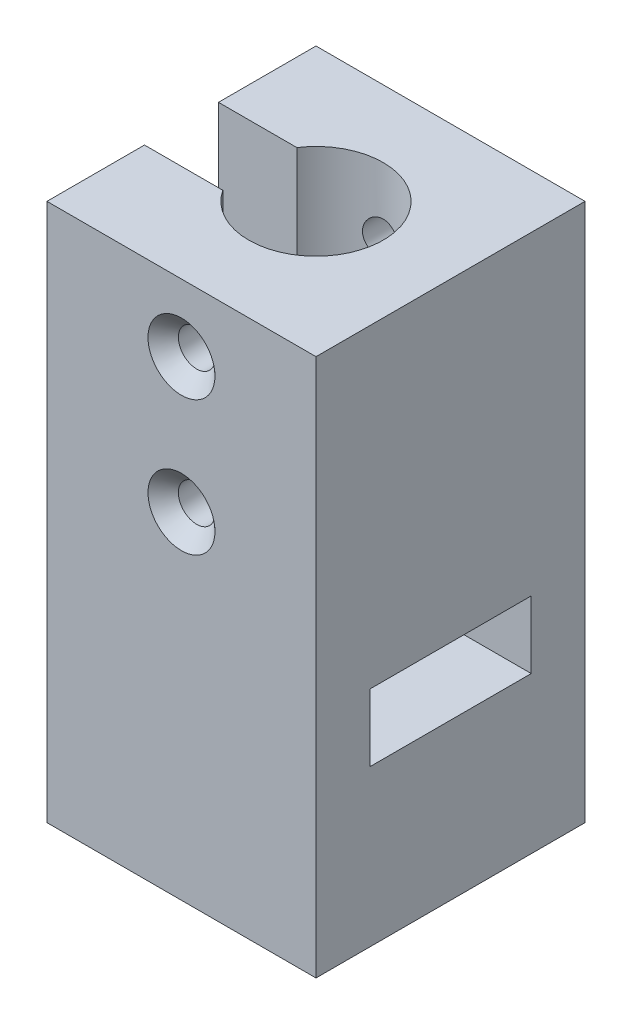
ISO-10303-21;
HEADER;
FILE_DESCRIPTION(('STEP AP214'),'2;1');
FILE_NAME('part.step','',(''),(''),'','','');
FILE_SCHEMA(('AUTOMOTIVE_DESIGN { 1 0 10303 214 1 1 1 1 }'));
ENDSEC;
DATA;
#1=APPLICATION_CONTEXT('core data for automotive mechanical design processes');
#2=APPLICATION_PROTOCOL_DEFINITION('international standard','automotive_design',2000,#1);
#3=PRODUCT_CONTEXT('',#1,'mechanical');
#4=PRODUCT('Part','Part','',(#3));
#5=PRODUCT_RELATED_PRODUCT_CATEGORY('part','',(#4));
#6=PRODUCT_DEFINITION_FORMATION('','',#4);
#7=PRODUCT_DEFINITION_CONTEXT('part definition',#1,'design');
#8=PRODUCT_DEFINITION('design','',#6,#7);
#9=PRODUCT_DEFINITION_SHAPE('','',#8);
#10=(LENGTH_UNIT() NAMED_UNIT(*) SI_UNIT(.MILLI.,.METRE.));
#11=(NAMED_UNIT(*) PLANE_ANGLE_UNIT() SI_UNIT($,.RADIAN.));
#12=(NAMED_UNIT(*) SI_UNIT($,.STERADIAN.) SOLID_ANGLE_UNIT());
#13=UNCERTAINTY_MEASURE_WITH_UNIT(LENGTH_MEASURE(1.E-05),#10,'distance_accuracy_value','');
#14=(GEOMETRIC_REPRESENTATION_CONTEXT(3) GLOBAL_UNCERTAINTY_ASSIGNED_CONTEXT((#13)) GLOBAL_UNIT_ASSIGNED_CONTEXT((#10,
#11,#12)) REPRESENTATION_CONTEXT('',''));
#15=CARTESIAN_POINT('',(0.,0.,0.));
#16=DIRECTION('',(0.,0.,1.));
#17=DIRECTION('',(1.,0.,0.));
#18=AXIS2_PLACEMENT_3D('',#15,#16,#17);
#19=CARTESIAN_POINT('',(-26.6053608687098,6.35,-9.48462085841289));
#20=DIRECTION('',(0.,1.,0.));
#21=DIRECTION('',(0.,0.,1.));
#22=AXIS2_PLACEMENT_3D('',#19,#20,#21);
#23=CYLINDRICAL_SURFACE('',#22,4.44499999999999);
#24=CARTESIAN_POINT('',(-26.6053608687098,14.732,-9.48462085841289));
#25=DIRECTION('',(0.,-1.,0.));
#26=DIRECTION('',(0.,0.,-1.));
#27=AXIS2_PLACEMENT_3D('',#24,#25,#26);
#28=CIRCLE('',#27,4.44499999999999);
#29=CARTESIAN_POINT('',(-26.6053608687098,14.732,-13.9296208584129));
#30=VERTEX_POINT('',#29);
#31=EDGE_CURVE('E268',#30,#30,#28,.F.);
#32=ORIENTED_EDGE('',*,*,#31,.T.);
#33=EDGE_LOOP('',(#32));
#34=FACE_BOUND('',#33,.T.);
#35=DIRECTION('',(0.,1.,0.));
#36=VECTOR('',#35,1.);
#37=CARTESIAN_POINT('',(-26.6053608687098,7.9502,-5.03962085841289));
#38=LINE('',#37,#36);
#39=CARTESIAN_POINT('',(-26.6053608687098,6.35,-5.03962085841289));
#40=VERTEX_POINT('',#39);
#41=CARTESIAN_POINT('',(-26.6053608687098,7.9502,-5.03962085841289));
#42=VERTEX_POINT('',#41);
#43=EDGE_CURVE('E199',#40,#42,#38,.T.);
#44=ORIENTED_EDGE('',*,*,#43,.T.);
#45=CARTESIAN_POINT('',(-26.6053608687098,7.9502,-9.48462085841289));
#46=DIRECTION('',(0.,1.,0.));
#47=DIRECTION('',(0.,0.,1.));
#48=AXIS2_PLACEMENT_3D('',#45,#46,#47);
#49=CIRCLE('',#48,4.44499999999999);
#50=CARTESIAN_POINT('',(-26.6053608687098,7.9502,-13.9296208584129));
#51=VERTEX_POINT('',#50);
#52=EDGE_CURVE('E13',#42,#51,#49,.F.);
#53=ORIENTED_EDGE('',*,*,#52,.T.);
#54=DIRECTION('',(0.,-1.,0.));
#55=VECTOR('',#54,1.);
#56=CARTESIAN_POINT('',(-26.6053608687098,7.9502,-13.9296208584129));
#57=LINE('',#56,#55);
#58=CARTESIAN_POINT('',(-26.6053608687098,6.35,-13.9296208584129));
#59=VERTEX_POINT('',#58);
#60=EDGE_CURVE('E203',#51,#59,#57,.T.);
#61=ORIENTED_EDGE('',*,*,#60,.T.);
#62=CARTESIAN_POINT('',(-26.6053608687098,6.35,-9.48462085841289));
#63=DIRECTION('',(0.,1.,0.));
#64=DIRECTION('',(0.,0.,1.));
#65=AXIS2_PLACEMENT_3D('',#62,#63,#64);
#66=CIRCLE('',#65,4.44499999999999);
#67=EDGE_CURVE('E188',#40,#59,#66,.T.);
#68=ORIENTED_EDGE('',*,*,#67,.F.);
#69=EDGE_LOOP('',(#44,#53,#61,#68));
#70=FACE_BOUND('',#69,.T.);
#71=ADVANCED_FACE('F59',(#34,#70),#23,.F.);
#72=DIRECTION('',(0.,1.,0.));
#73=VECTOR('',#72,1.);
#74=CARTESIAN_POINT('',(-29.3549915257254,6.35,-12.9771208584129));
#75=LINE('',#74,#73);
#76=CARTESIAN_POINT('',(-29.3549915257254,25.4,-12.9771208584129));
#77=VERTEX_POINT('',#76);
#78=CARTESIAN_POINT('',(-29.3549915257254,21.082,-12.9771208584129));
#79=VERTEX_POINT('',#78);
#80=EDGE_CURVE('E262',#77,#79,#75,.F.);
#81=ORIENTED_EDGE('',*,*,#80,.T.);
#82=CARTESIAN_POINT('',(-26.6053608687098,21.082,-9.48462085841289));
#83=DIRECTION('',(0.,1.,0.));
#84=DIRECTION('',(0.,0.,1.));
#85=AXIS2_PLACEMENT_3D('',#82,#83,#84);
#86=CIRCLE('',#85,4.44499999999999);
#87=CARTESIAN_POINT('',(-29.3549915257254,21.082,-5.99212085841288));
#88=VERTEX_POINT('',#87);
#89=EDGE_CURVE('E281',#79,#88,#86,.F.);
#90=ORIENTED_EDGE('',*,*,#89,.T.);
#91=DIRECTION('',(0.,1.,0.));
#92=VECTOR('',#91,1.);
#93=CARTESIAN_POINT('',(-29.3549915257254,6.35,-5.99212085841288));
#94=LINE('',#93,#92);
#95=CARTESIAN_POINT('',(-29.3549915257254,25.4,-5.99212085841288));
#96=VERTEX_POINT('',#95);
#97=EDGE_CURVE('E258',#88,#96,#94,.T.);
#98=ORIENTED_EDGE('',*,*,#97,.T.);
#99=CARTESIAN_POINT('',(-26.6053608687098,25.4,-9.48462085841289));
#100=DIRECTION('',(0.,1.,0.));
#101=DIRECTION('',(0.,0.,1.));
#102=AXIS2_PLACEMENT_3D('',#99,#100,#101);
#103=CIRCLE('',#102,4.44499999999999);
#104=EDGE_CURVE('E207',#77,#96,#103,.F.);
#105=ORIENTED_EDGE('',*,*,#104,.F.);
#106=EDGE_LOOP('',(#81,#90,#98,#105));
#107=FACE_BOUND('',#106,.T.);
#108=ADVANCED_FACE('F470',(#107),#23,.F.);
#109=CARTESIAN_POINT('',(-39.3053608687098,50.8,-22.1846208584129));
#110=DIRECTION('',(1.,0.,0.));
#111=DIRECTION('',(0.,0.,-1.));
#112=AXIS2_PLACEMENT_3D('',#109,#110,#111);
#113=PLANE('',#112);
#114=DIRECTION('',(0.,0.,1.));
#115=VECTOR('',#114,1.);
#116=CARTESIAN_POINT('',(-39.3053608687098,6.35,-13.9296208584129));
#117=LINE('',#116,#115);
#118=CARTESIAN_POINT('',(-39.3053608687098,6.35,-13.9296208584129));
#119=VERTEX_POINT('',#118);
#120=CARTESIAN_POINT('',(-39.3053608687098,6.35,-5.03962085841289));
#121=VERTEX_POINT('',#120);
#122=EDGE_CURVE('E190',#119,#121,#117,.T.);
#123=ORIENTED_EDGE('',*,*,#122,.F.);
#124=DIRECTION('',(0.,-1.,0.));
#125=VECTOR('',#124,1.);
#126=CARTESIAN_POINT('',(-39.3053608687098,7.9502,-13.9296208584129));
#127=LINE('',#126,#125);
#128=CARTESIAN_POINT('',(-39.3053608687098,7.9502,-13.9296208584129));
#129=VERTEX_POINT('',#128);
#130=EDGE_CURVE('E75',#129,#119,#127,.T.);
#131=ORIENTED_EDGE('',*,*,#130,.F.);
#132=DIRECTION('',(0.,0.,-1.));
#133=VECTOR('',#132,1.);
#134=CARTESIAN_POINT('',(-39.3053608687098,7.9502,-13.9296208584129));
#135=LINE('',#134,#133);
#136=CARTESIAN_POINT('',(-39.3053608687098,7.9502,-5.03962085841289));
#137=VERTEX_POINT('',#136);
#138=EDGE_CURVE('E730',#137,#129,#135,.T.);
#139=ORIENTED_EDGE('',*,*,#138,.F.);
#140=DIRECTION('',(0.,1.,0.));
#141=VECTOR('',#140,1.);
#142=CARTESIAN_POINT('',(-39.3053608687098,7.9502,-5.03962085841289));
#143=LINE('',#142,#141);
#144=EDGE_CURVE('E725',#121,#137,#143,.T.);
#145=ORIENTED_EDGE('',*,*,#144,.F.);
#146=EDGE_LOOP('',(#123,#131,#139,#145));
#147=FACE_BOUND('',#146,.T.);
#148=DIRECTION('',(0.,-1.,0.));
#149=VECTOR('',#148,1.);
#150=CARTESIAN_POINT('',(-39.3053608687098,21.082,-17.1046208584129));
#151=LINE('',#150,#149);
#152=CARTESIAN_POINT('',(-39.3053608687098,21.082,-17.1046208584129));
#153=VERTEX_POINT('',#152);
#154=CARTESIAN_POINT('',(-39.3053608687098,14.732,-17.1046208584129));
#155=VERTEX_POINT('',#154);
#156=EDGE_CURVE('E337',#153,#155,#151,.T.);
#157=ORIENTED_EDGE('',*,*,#156,.F.);
#158=DIRECTION('',(0.,0.,-1.));
#159=VECTOR('',#158,1.);
#160=CARTESIAN_POINT('',(-39.3053608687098,21.082,-17.1046208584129));
#161=LINE('',#160,#159);
#162=CARTESIAN_POINT('',(-39.3053608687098,21.082,-12.9771208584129));
#163=VERTEX_POINT('',#162);
#164=EDGE_CURVE('E334',#163,#153,#161,.T.);
#165=ORIENTED_EDGE('',*,*,#164,.F.);
#166=DIRECTION('',(0.,-1.,0.));
#167=VECTOR('',#166,1.);
#168=CARTESIAN_POINT('',(-39.3053608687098,50.8,-12.9771208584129));
#169=LINE('',#168,#167);
#170=CARTESIAN_POINT('',(-39.3053608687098,50.8,-12.9771208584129));
#171=VERTEX_POINT('',#170);
#172=EDGE_CURVE('E271',#171,#163,#169,.T.);
#173=ORIENTED_EDGE('',*,*,#172,.F.);
#174=DIRECTION('',(0.,0.,1.));
#175=VECTOR('',#174,1.);
#176=CARTESIAN_POINT('',(-39.3053608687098,50.8,-22.1846208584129));
#177=LINE('',#176,#175);
#178=CARTESIAN_POINT('',(-39.3053608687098,50.8,-22.1846208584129));
#179=VERTEX_POINT('',#178);
#180=EDGE_CURVE('E221',#179,#171,#177,.T.);
#181=ORIENTED_EDGE('',*,*,#180,.F.);
#182=DIRECTION('',(0.,-1.,0.));
#183=VECTOR('',#182,1.);
#184=CARTESIAN_POINT('',(-39.3053608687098,50.8,-22.1846208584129));
#185=LINE('',#184,#183);
#186=CARTESIAN_POINT('',(-39.3053608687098,0.,-22.1846208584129));
#187=VERTEX_POINT('',#186);
#188=EDGE_CURVE('E234',#179,#187,#185,.T.);
#189=ORIENTED_EDGE('',*,*,#188,.T.);
#190=DIRECTION('',(0.,0.,1.));
#191=VECTOR('',#190,1.);
#192=CARTESIAN_POINT('',(-39.3053608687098,0.,-22.1846208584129));
#193=LINE('',#192,#191);
#194=CARTESIAN_POINT('',(-39.3053608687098,0.,3.21537914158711));
#195=VERTEX_POINT('',#194);
#196=EDGE_CURVE('E206',#187,#195,#193,.T.);
#197=ORIENTED_EDGE('',*,*,#196,.T.);
#198=DIRECTION('',(0.,-1.,0.));
#199=VECTOR('',#198,1.);
#200=CARTESIAN_POINT('',(-39.3053608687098,50.8,3.21537914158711));
#201=LINE('',#200,#199);
#202=CARTESIAN_POINT('',(-39.3053608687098,50.8,3.21537914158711));
#203=VERTEX_POINT('',#202);
#204=EDGE_CURVE('E255',#203,#195,#201,.T.);
#205=ORIENTED_EDGE('',*,*,#204,.F.);
#206=CARTESIAN_POINT('',(-39.3053608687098,50.8,-5.99212085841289));
#207=VERTEX_POINT('',#206);
#208=EDGE_CURVE('E226',#207,#203,#177,.T.);
#209=ORIENTED_EDGE('',*,*,#208,.F.);
#210=DIRECTION('',(0.,1.,0.));
#211=VECTOR('',#210,1.);
#212=CARTESIAN_POINT('',(-39.3053608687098,50.8,-5.99212085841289));
#213=LINE('',#212,#211);
#214=CARTESIAN_POINT('',(-39.3053608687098,21.082,-5.99212085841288));
#215=VERTEX_POINT('',#214);
#216=EDGE_CURVE('E278',#215,#207,#213,.T.);
#217=ORIENTED_EDGE('',*,*,#216,.F.);
#218=CARTESIAN_POINT('',(-39.3053608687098,21.082,-1.86462085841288));
#219=VERTEX_POINT('',#218);
#220=EDGE_CURVE('E341',#219,#215,#161,.T.);
#221=ORIENTED_EDGE('',*,*,#220,.F.);
#222=DIRECTION('',(0.,1.,0.));
#223=VECTOR('',#222,1.);
#224=CARTESIAN_POINT('',(-39.3053608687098,21.082,-1.86462085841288));
#225=LINE('',#224,#223);
#226=CARTESIAN_POINT('',(-39.3053608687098,14.732,-1.86462085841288));
#227=VERTEX_POINT('',#226);
#228=EDGE_CURVE('E342',#227,#219,#225,.T.);
#229=ORIENTED_EDGE('',*,*,#228,.F.);
#230=DIRECTION('',(0.,0.,1.));
#231=VECTOR('',#230,1.);
#232=CARTESIAN_POINT('',(-39.3053608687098,14.732,-17.1046208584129));
#233=LINE('',#232,#231);
#234=EDGE_CURVE('E348',#155,#227,#233,.T.);
#235=ORIENTED_EDGE('',*,*,#234,.F.);
#236=EDGE_LOOP('',(#157,#165,#173,#181,#189,#197,#205,#209,#217,#221,#229,#235));
#237=FACE_BOUND('',#236,.T.);
#238=ADVANCED_FACE('F61',(#147,#237),#113,.F.);
#239=CARTESIAN_POINT('',(-39.3053608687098,50.8,3.21537914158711));
#240=DIRECTION('',(0.,0.,-1.));
#241=DIRECTION('',(-1.,0.,0.));
#242=AXIS2_PLACEMENT_3D('',#239,#240,#241);
#243=PLANE('',#242);
#244=CARTESIAN_POINT('',(-26.6053608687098,44.45,3.21537914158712));
#245=DIRECTION('',(0.,0.,1.));
#246=DIRECTION('',(1.,0.,0.));
#247=AXIS2_PLACEMENT_3D('',#244,#245,#246);
#248=CIRCLE('',#247,3.1623);
#249=CARTESIAN_POINT('',(-23.4430608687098,44.45,3.21537914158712));
#250=VERTEX_POINT('',#249);
#251=EDGE_CURVE('E740',#250,#250,#248,.T.);
#252=ORIENTED_EDGE('',*,*,#251,.F.);
#253=EDGE_LOOP('',(#252));
#254=FACE_BOUND('',#253,.T.);
#255=CARTESIAN_POINT('',(-26.6053608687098,31.75,3.21537914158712));
#256=DIRECTION('',(0.,0.,1.));
#257=DIRECTION('',(1.,0.,0.));
#258=AXIS2_PLACEMENT_3D('',#255,#256,#257);
#259=CIRCLE('',#258,3.1623);
#260=CARTESIAN_POINT('',(-23.4430608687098,31.75,3.21537914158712));
#261=VERTEX_POINT('',#260);
#262=EDGE_CURVE('E760',#261,#261,#259,.T.);
#263=ORIENTED_EDGE('',*,*,#262,.F.);
#264=EDGE_LOOP('',(#263));
#265=FACE_BOUND('',#264,.T.);
#266=DIRECTION('',(1.,0.,0.));
#267=VECTOR('',#266,1.);
#268=CARTESIAN_POINT('',(-39.3053608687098,0.,3.21537914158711));
#269=LINE('',#268,#267);
#270=CARTESIAN_POINT('',(-13.9053608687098,0.,3.21537914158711));
#271=VERTEX_POINT('',#270);
#272=EDGE_CURVE('E212',#195,#271,#269,.T.);
#273=ORIENTED_EDGE('',*,*,#272,.T.);
#274=DIRECTION('',(0.,-1.,0.));
#275=VECTOR('',#274,1.);
#276=CARTESIAN_POINT('',(-13.9053608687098,50.8,3.21537914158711));
#277=LINE('',#276,#275);
#278=CARTESIAN_POINT('',(-13.9053608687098,50.8,3.21537914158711));
#279=VERTEX_POINT('',#278);
#280=EDGE_CURVE('E251',#279,#271,#277,.T.);
#281=ORIENTED_EDGE('',*,*,#280,.F.);
#282=DIRECTION('',(1.,0.,0.));
#283=VECTOR('',#282,1.);
#284=CARTESIAN_POINT('',(-39.3053608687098,50.8,3.21537914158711));
#285=LINE('',#284,#283);
#286=EDGE_CURVE('E225',#203,#279,#285,.T.);
#287=ORIENTED_EDGE('',*,*,#286,.F.);
#288=ORIENTED_EDGE('',*,*,#204,.T.);
#289=EDGE_LOOP('',(#273,#281,#287,#288));
#290=FACE_BOUND('',#289,.T.);
#291=ADVANCED_FACE('F460',(#254,#265,#290),#243,.F.);
#292=CARTESIAN_POINT('',(-13.9053608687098,50.8,-22.1846208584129));
#293=DIRECTION('',(-1.,0.,0.));
#294=DIRECTION('',(0.,0.,1.));
#295=AXIS2_PLACEMENT_3D('',#292,#293,#294);
#296=PLANE('',#295);
#297=DIRECTION('',(0.,0.,-1.));
#298=VECTOR('',#297,1.);
#299=CARTESIAN_POINT('',(-13.9053608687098,21.082,-17.1046208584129));
#300=LINE('',#299,#298);
#301=CARTESIAN_POINT('',(-13.9053608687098,21.082,-1.86462085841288));
#302=VERTEX_POINT('',#301);
#303=CARTESIAN_POINT('',(-13.9053608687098,21.082,-17.1046208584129));
#304=VERTEX_POINT('',#303);
#305=EDGE_CURVE('E361',#302,#304,#300,.T.);
#306=ORIENTED_EDGE('',*,*,#305,.T.);
#307=DIRECTION('',(0.,-1.,0.));
#308=VECTOR('',#307,1.);
#309=CARTESIAN_POINT('',(-13.9053608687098,21.082,-17.1046208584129));
#310=LINE('',#309,#308);
#311=CARTESIAN_POINT('',(-13.9053608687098,14.732,-17.1046208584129));
#312=VERTEX_POINT('',#311);
#313=EDGE_CURVE('E346',#304,#312,#310,.T.);
#314=ORIENTED_EDGE('',*,*,#313,.T.);
#315=DIRECTION('',(0.,0.,1.));
#316=VECTOR('',#315,1.);
#317=CARTESIAN_POINT('',(-13.9053608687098,14.732,-17.1046208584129));
#318=LINE('',#317,#316);
#319=CARTESIAN_POINT('',(-13.9053608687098,14.732,-1.86462085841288));
#320=VERTEX_POINT('',#319);
#321=EDGE_CURVE('E374',#312,#320,#318,.T.);
#322=ORIENTED_EDGE('',*,*,#321,.T.);
#323=DIRECTION('',(0.,1.,0.));
#324=VECTOR('',#323,1.);
#325=CARTESIAN_POINT('',(-13.9053608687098,21.082,-1.86462085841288));
#326=LINE('',#325,#324);
#327=EDGE_CURVE('E367',#320,#302,#326,.T.);
#328=ORIENTED_EDGE('',*,*,#327,.T.);
#329=EDGE_LOOP('',(#306,#314,#322,#328));
#330=FACE_BOUND('',#329,.T.);
#331=DIRECTION('',(0.,0.,-1.));
#332=VECTOR('',#331,1.);
#333=CARTESIAN_POINT('',(-13.9053608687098,0.,-22.1846208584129));
#334=LINE('',#333,#332);
#335=CARTESIAN_POINT('',(-13.9053608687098,0.,-22.1846208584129));
#336=VERTEX_POINT('',#335);
#337=EDGE_CURVE('E238',#271,#336,#334,.T.);
#338=ORIENTED_EDGE('',*,*,#337,.T.);
#339=DIRECTION('',(0.,-1.,0.));
#340=VECTOR('',#339,1.);
#341=CARTESIAN_POINT('',(-13.9053608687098,50.8,-22.1846208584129));
#342=LINE('',#341,#340);
#343=CARTESIAN_POINT('',(-13.9053608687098,50.8,-22.1846208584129));
#344=VERTEX_POINT('',#343);
#345=EDGE_CURVE('E247',#344,#336,#342,.T.);
#346=ORIENTED_EDGE('',*,*,#345,.F.);
#347=DIRECTION('',(0.,0.,-1.));
#348=VECTOR('',#347,1.);
#349=CARTESIAN_POINT('',(-13.9053608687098,50.8,-22.1846208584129));
#350=LINE('',#349,#348);
#351=EDGE_CURVE('E229',#279,#344,#350,.T.);
#352=ORIENTED_EDGE('',*,*,#351,.F.);
#353=ORIENTED_EDGE('',*,*,#280,.T.);
#354=EDGE_LOOP('',(#338,#346,#352,#353));
#355=FACE_BOUND('',#354,.T.);
#356=ADVANCED_FACE('F390',(#330,#355),#296,.F.);
#357=CARTESIAN_POINT('',(-39.3053608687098,50.8,-22.1846208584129));
#358=DIRECTION('',(0.,0.,1.));
#359=DIRECTION('',(1.,0.,0.));
#360=AXIS2_PLACEMENT_3D('',#357,#358,#359);
#361=PLANE('',#360);
#362=CARTESIAN_POINT('',(-26.6053608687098,44.45,-22.1846208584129));
#363=DIRECTION('',(0.,0.,-1.));
#364=DIRECTION('',(-1.,0.,0.));
#365=AXIS2_PLACEMENT_3D('',#362,#363,#364);
#366=CIRCLE('',#365,3.1623);
#367=CARTESIAN_POINT('',(-29.7676608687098,44.45,-22.1846208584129));
#368=VERTEX_POINT('',#367);
#369=EDGE_CURVE('E775',#368,#368,#366,.T.);
#370=ORIENTED_EDGE('',*,*,#369,.F.);
#371=EDGE_LOOP('',(#370));
#372=FACE_BOUND('',#371,.T.);
#373=CARTESIAN_POINT('',(-26.6053608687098,31.75,-22.1846208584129));
#374=DIRECTION('',(0.,0.,-1.));
#375=DIRECTION('',(-1.,0.,0.));
#376=AXIS2_PLACEMENT_3D('',#373,#374,#375);
#377=CIRCLE('',#376,3.1623);
#378=CARTESIAN_POINT('',(-29.7676608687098,31.75,-22.1846208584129));
#379=VERTEX_POINT('',#378);
#380=EDGE_CURVE('E431',#379,#379,#377,.T.);
#381=ORIENTED_EDGE('',*,*,#380,.F.);
#382=EDGE_LOOP('',(#381));
#383=FACE_BOUND('',#382,.T.);
#384=DIRECTION('',(-1.,0.,0.));
#385=VECTOR('',#384,1.);
#386=CARTESIAN_POINT('',(-39.3053608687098,0.,-22.1846208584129));
#387=LINE('',#386,#385);
#388=EDGE_CURVE('E241',#336,#187,#387,.T.);
#389=ORIENTED_EDGE('',*,*,#388,.T.);
#390=ORIENTED_EDGE('',*,*,#188,.F.);
#391=DIRECTION('',(-1.,0.,0.));
#392=VECTOR('',#391,1.);
#393=CARTESIAN_POINT('',(-39.3053608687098,50.8,-22.1846208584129));
#394=LINE('',#393,#392);
#395=EDGE_CURVE('E232',#344,#179,#394,.T.);
#396=ORIENTED_EDGE('',*,*,#395,.F.);
#397=ORIENTED_EDGE('',*,*,#345,.T.);
#398=EDGE_LOOP('',(#389,#390,#396,#397));
#399=FACE_BOUND('',#398,.T.);
#400=ADVANCED_FACE('F443',(#372,#383,#399),#361,.F.);
#401=CARTESIAN_POINT('',(0.,50.8,0.));
#402=DIRECTION('',(0.,1.,0.));
#403=DIRECTION('',(0.,0.,1.));
#404=AXIS2_PLACEMENT_3D('',#401,#402,#403);
#405=PLANE('',#404);
#406=DIRECTION('',(-1.,0.,0.));
#407=VECTOR('',#406,1.);
#408=CARTESIAN_POINT('',(-26.6053608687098,50.8,-12.9771208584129));
#409=LINE('',#408,#407);
#410=CARTESIAN_POINT('',(-31.9086564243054,50.8,-12.9771208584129));
#411=VERTEX_POINT('',#410);
#412=EDGE_CURVE('E293',#411,#171,#409,.T.);
#413=ORIENTED_EDGE('',*,*,#412,.F.);
#414=CARTESIAN_POINT('',(-26.6053608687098,50.8,-9.48462085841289));
#415=DIRECTION('',(0.,1.,0.));
#416=DIRECTION('',(0.,0.,1.));
#417=AXIS2_PLACEMENT_3D('',#414,#415,#416);
#418=CIRCLE('',#417,6.35);
#419=CARTESIAN_POINT('',(-31.9086564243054,50.8,-5.99212085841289));
#420=VERTEX_POINT('',#419);
#421=EDGE_CURVE('E219',#420,#411,#418,.T.);
#422=ORIENTED_EDGE('',*,*,#421,.F.);
#423=DIRECTION('',(-1.,0.,0.));
#424=VECTOR('',#423,1.);
#425=CARTESIAN_POINT('',(-26.6053608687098,50.8,-5.99212085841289));
#426=LINE('',#425,#424);
#427=EDGE_CURVE('E292',#420,#207,#426,.T.);
#428=ORIENTED_EDGE('',*,*,#427,.T.);
#429=ORIENTED_EDGE('',*,*,#208,.T.);
#430=ORIENTED_EDGE('',*,*,#286,.T.);
#431=ORIENTED_EDGE('',*,*,#351,.T.);
#432=ORIENTED_EDGE('',*,*,#395,.T.);
#433=ORIENTED_EDGE('',*,*,#180,.T.);
#434=EDGE_LOOP('',(#413,#422,#428,#429,#430,#431,#432,#433));
#435=FACE_BOUND('',#434,.T.);
#436=ADVANCED_FACE('F326',(#435),#405,.T.);
#437=CARTESIAN_POINT('',(0.,0.,0.));
#438=DIRECTION('',(0.,1.,0.));
#439=DIRECTION('',(0.,0.,1.));
#440=AXIS2_PLACEMENT_3D('',#437,#438,#439);
#441=PLANE('',#440);
#442=ORIENTED_EDGE('',*,*,#196,.F.);
#443=ORIENTED_EDGE('',*,*,#388,.F.);
#444=ORIENTED_EDGE('',*,*,#337,.F.);
#445=ORIENTED_EDGE('',*,*,#272,.F.);
#446=EDGE_LOOP('',(#442,#443,#444,#445));
#447=FACE_BOUND('',#446,.T.);
#448=ADVANCED_FACE('F456',(#447),#441,.F.);
#449=CARTESIAN_POINT('',(-26.6053608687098,25.4,-9.48462085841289));
#450=DIRECTION('',(0.,1.,0.));
#451=DIRECTION('',(0.,0.,1.));
#452=AXIS2_PLACEMENT_3D('',#449,#450,#451);
#453=PLANE('',#452);
#454=DIRECTION('',(-1.,0.,0.));
#455=VECTOR('',#454,1.);
#456=CARTESIAN_POINT('',(-26.6053608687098,25.4,-12.9771208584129));
#457=LINE('',#456,#455);
#458=CARTESIAN_POINT('',(-31.9086564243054,25.4,-12.9771208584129));
#459=VERTEX_POINT('',#458);
#460=EDGE_CURVE('E307',#77,#459,#457,.T.);
#461=ORIENTED_EDGE('',*,*,#460,.F.);
#462=ORIENTED_EDGE('',*,*,#104,.T.);
#463=DIRECTION('',(1.,0.,0.));
#464=VECTOR('',#463,1.);
#465=CARTESIAN_POINT('',(-26.6053608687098,25.4,-5.99212085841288));
#466=LINE('',#465,#464);
#467=CARTESIAN_POINT('',(-31.9086564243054,25.4,-5.99212085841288));
#468=VERTEX_POINT('',#467);
#469=EDGE_CURVE('E296',#468,#96,#466,.T.);
#470=ORIENTED_EDGE('',*,*,#469,.F.);
#471=CARTESIAN_POINT('',(-26.6053608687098,25.4,-9.48462085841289));
#472=DIRECTION('',(0.,1.,0.));
#473=DIRECTION('',(0.,0.,1.));
#474=AXIS2_PLACEMENT_3D('',#471,#472,#473);
#475=CIRCLE('',#474,6.35);
#476=EDGE_CURVE('E215',#468,#459,#475,.T.);
#477=ORIENTED_EDGE('',*,*,#476,.T.);
#478=EDGE_LOOP('',(#461,#462,#470,#477));
#479=FACE_BOUND('',#478,.T.);
#480=ADVANCED_FACE('F482',(#479),#453,.T.);
#481=CARTESIAN_POINT('',(-26.6053608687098,25.4,-9.48462085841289));
#482=DIRECTION('',(0.,1.,0.));
#483=DIRECTION('',(0.,0.,1.));
#484=AXIS2_PLACEMENT_3D('',#481,#482,#483);
#485=CYLINDRICAL_SURFACE('',#484,6.35);
#486=CARTESIAN_POINT('',(-24.8781608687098,44.45,-3.37403331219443));
#487=CARTESIAN_POINT('',(-24.8781630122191,44.3549284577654,-3.3740317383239));
#488=CARTESIAN_POINT('',(-24.8860372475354,44.2598345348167,-3.37179029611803));
#489=CARTESIAN_POINT('',(-24.9172632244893,44.0723981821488,-3.36309486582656));
#490=CARTESIAN_POINT('',(-24.9406223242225,43.9800570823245,-3.35663887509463));
#491=CARTESIAN_POINT('',(-25.0019892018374,43.8008651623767,-3.34029842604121));
#492=CARTESIAN_POINT('',(-25.0399758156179,43.7140066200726,-3.3304189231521));
#493=CARTESIAN_POINT('',(-25.1294525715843,43.5478804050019,-3.30835099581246));
#494=CARTESIAN_POINT('',(-25.1809439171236,43.4686134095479,-3.29616236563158));
#495=CARTESIAN_POINT('',(-25.2974014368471,43.3178578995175,-3.27049410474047));
#496=CARTESIAN_POINT('',(-25.3626560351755,43.246596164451,-3.25699085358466));
#497=CARTESIAN_POINT('',(-25.5041677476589,43.1158810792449,-3.23041837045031));
#498=CARTESIAN_POINT('',(-25.5804260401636,43.0564289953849,-3.21734918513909));
#499=CARTESIAN_POINT('',(-25.7433591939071,42.9500692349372,-3.19285307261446));
#500=CARTESIAN_POINT('',(-25.8301868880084,42.9033878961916,-3.18145725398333));
#501=CARTESIAN_POINT('',(-26.0108204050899,42.8253723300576,-3.16186341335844));
#502=CARTESIAN_POINT('',(-26.1046249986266,42.7940354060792,-3.15366482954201));
#503=CARTESIAN_POINT('',(-26.2941815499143,42.7483346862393,-3.14155625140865));
#504=CARTESIAN_POINT('',(-26.3898341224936,42.7335849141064,-3.13754889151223));
#505=CARTESIAN_POINT('',(-26.5823344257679,42.7202619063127,-3.13393348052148));
#506=CARTESIAN_POINT('',(-26.6791819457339,42.7216858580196,-3.13432466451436));
#507=CARTESIAN_POINT('',(-26.8686332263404,42.7404000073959,-3.13939130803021));
#508=CARTESIAN_POINT('',(-26.961281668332,42.7572730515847,-3.14395412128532));
#509=CARTESIAN_POINT('',(-27.1423789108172,42.8057313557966,-3.15671781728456));
#510=CARTESIAN_POINT('',(-27.2308274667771,42.837317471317,-3.16491891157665));
#511=CARTESIAN_POINT('',(-27.4020678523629,42.914619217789,-3.18420302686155));
#512=CARTESIAN_POINT('',(-27.4847926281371,42.9604759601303,-3.19531464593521));
#513=CARTESIAN_POINT('',(-27.6415138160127,43.0649084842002,-3.2192253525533));
#514=CARTESIAN_POINT('',(-27.7155084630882,43.1234868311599,-3.23202478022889));
#515=CARTESIAN_POINT('',(-27.8551591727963,43.2539066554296,-3.25840846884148));
#516=CARTESIAN_POINT('',(-27.9204738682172,43.3261116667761,-3.2720047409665));
#517=CARTESIAN_POINT('',(-28.0381527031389,43.4805898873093,-3.29808301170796));
#518=CARTESIAN_POINT('',(-28.0905159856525,43.5628637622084,-3.31056493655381));
#519=CARTESIAN_POINT('',(-28.1810796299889,43.7359083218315,-3.3330509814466));
#520=CARTESIAN_POINT('',(-28.2191836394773,43.8267317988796,-3.34303809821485));
#521=CARTESIAN_POINT('',(-28.2794679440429,44.0138359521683,-3.35919431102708));
#522=CARTESIAN_POINT('',(-28.3016523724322,44.110115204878,-3.36536439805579));
#523=CARTESIAN_POINT('',(-28.3288718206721,44.3021965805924,-3.37297582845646));
#524=CARTESIAN_POINT('',(-28.3344175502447,44.3979208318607,-3.3745579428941));
#525=CARTESIAN_POINT('',(-28.3296122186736,44.5889296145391,-3.37320008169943));
#526=CARTESIAN_POINT('',(-28.3192629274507,44.6842141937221,-3.37026060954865));
#527=CARTESIAN_POINT('',(-28.2834123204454,44.869646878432,-3.36032710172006));
#528=CARTESIAN_POINT('',(-28.2582212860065,44.9598598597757,-3.35341616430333));
#529=CARTESIAN_POINT('',(-28.1937527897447,45.1347792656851,-3.33640035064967));
#530=CARTESIAN_POINT('',(-28.1544734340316,45.2194849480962,-3.32629504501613));
#531=CARTESIAN_POINT('',(-28.0619170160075,45.3831129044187,-3.30374263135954));
#532=CARTESIAN_POINT('',(-28.0083418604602,45.4618597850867,-3.29124748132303));
#533=CARTESIAN_POINT('',(-27.8890817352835,45.6094330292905,-3.26543474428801));
#534=CARTESIAN_POINT('',(-27.8233943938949,45.6782574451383,-3.25211699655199));
#535=CARTESIAN_POINT('',(-27.6794062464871,45.8061693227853,-3.22567250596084));
#536=CARTESIAN_POINT('',(-27.6007842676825,45.8648997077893,-3.21256369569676));
#537=CARTESIAN_POINT('',(-27.4345025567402,45.9683308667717,-3.18842586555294));
#538=CARTESIAN_POINT('',(-27.3468433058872,46.0130323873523,-3.17739673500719));
#539=CARTESIAN_POINT('',(-27.1655921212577,46.0867209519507,-3.15873206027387));
#540=CARTESIAN_POINT('',(-27.0720509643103,46.1158261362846,-3.15107108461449));
#541=CARTESIAN_POINT('',(-26.8811648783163,46.1578338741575,-3.13989383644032));
#542=CARTESIAN_POINT('',(-26.7838208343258,46.1707401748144,-3.13637660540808));
#543=CARTESIAN_POINT('',(-26.5914223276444,46.1797411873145,-3.13393042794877));
#544=CARTESIAN_POINT('',(-26.4963937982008,46.1763586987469,-3.13485879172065));
#545=CARTESIAN_POINT('',(-26.3083112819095,46.1540975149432,-3.14087472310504));
#546=CARTESIAN_POINT('',(-26.2152572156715,46.1352194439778,-3.14596212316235));
#547=CARTESIAN_POINT('',(-26.0344208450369,46.0828032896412,-3.15969418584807));
#548=CARTESIAN_POINT('',(-25.946604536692,46.0493750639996,-3.16831216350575));
#549=CARTESIAN_POINT('',(-25.7777772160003,45.9689053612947,-3.18820607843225));
#550=CARTESIAN_POINT('',(-25.6967671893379,45.9218619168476,-3.19948239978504));
#551=CARTESIAN_POINT('',(-25.5414335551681,45.813988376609,-3.22387689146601));
#552=CARTESIAN_POINT('',(-25.4673553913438,45.7528144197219,-3.23703721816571));
#553=CARTESIAN_POINT('',(-25.3303393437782,45.6190634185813,-3.26355177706));
#554=CARTESIAN_POINT('',(-25.2674044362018,45.5464833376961,-3.27690606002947));
#555=CARTESIAN_POINT('',(-25.1530161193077,45.3899605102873,-3.30265359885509));
#556=CARTESIAN_POINT('',(-25.1018620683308,45.3057937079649,-3.31501746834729));
#557=CARTESIAN_POINT('',(-25.0145016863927,45.1297283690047,-3.33696202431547));
#558=CARTESIAN_POINT('',(-24.9782859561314,45.0378347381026,-3.34654445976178));
#559=CARTESIAN_POINT('',(-24.926350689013,44.8636202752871,-3.36056762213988));
#560=CARTESIAN_POINT('',(-24.9083229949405,44.7820261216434,-3.36557540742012));
#561=CARTESIAN_POINT('',(-24.884227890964,44.6169602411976,-3.37230873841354));
#562=CARTESIAN_POINT('',(-24.8781589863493,44.5334887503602,-3.37403469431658));
#563=CARTESIAN_POINT('',(-24.8781608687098,44.45,-3.37403331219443));
#564=B_SPLINE_CURVE_WITH_KNOTS('',3,(#486,#487,#488,#489,#490,#491,#492,#493,#494,#495,#496,
#497,#498,#499,#500,#501,#502,#503,#504,#505,#506,#507,#508,#509,#510,#511,#512,#513,#514,#515,
#516,#517,#518,#519,#520,#521,#522,#523,#524,#525,#526,#527,#528,#529,#530,#531,#532,#533,#534,
#535,#536,#537,#538,#539,#540,#541,#542,#543,#544,#545,#546,#547,#548,#549,#550,#551,#552,#553,
#554,#555,#556,#557,#558,#559,#560,#561,#562,#563),.UNSPECIFIED.,.T.,.F.,(4,2,2,2,2,2,2,2,2,2,2,
2,2,2,2,2,2,2,2,2,2,2,2,2,2,2,2,2,2,2,2,2,2,2,2,2,2,2,4),(0.,0.284907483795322,
0.569950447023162,0.854582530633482,1.13923998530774,1.4305920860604,1.72197540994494,
2.01823016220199,2.31443283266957,2.60359035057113,2.89269758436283,3.17422149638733,
3.45576177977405,3.74017954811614,4.02465472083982,4.31820614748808,4.6117769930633,
4.90729718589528,5.20274062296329,5.48901787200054,5.77526324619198,6.05572669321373,
6.33622785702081,6.62310984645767,6.91004807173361,7.20565699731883,7.50125018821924,
7.79457145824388,8.08782486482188,8.37173002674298,8.65562375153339,8.93741020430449,
9.21923739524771,9.50882250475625,9.79848484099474,10.0948495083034,10.3910274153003,
10.641255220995,10.8914517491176),.UNSPECIFIED.);
#565=CARTESIAN_POINT('',(-24.8781608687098,44.45,-3.37403331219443));
#566=VERTEX_POINT('',#565);
#567=EDGE_CURVE('E749',#566,#566,#564,.T.);
#568=ORIENTED_EDGE('',*,*,#567,.F.);
#569=EDGE_LOOP('',(#568));
#570=FACE_BOUND('',#569,.T.);
#571=CARTESIAN_POINT('',(-24.8781608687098,31.75,-3.37403331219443));
#572=CARTESIAN_POINT('',(-24.8781630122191,31.6549284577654,-3.3740317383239));
#573=CARTESIAN_POINT('',(-24.8860372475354,31.5598345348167,-3.37179029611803));
#574=CARTESIAN_POINT('',(-24.9172632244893,31.3723981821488,-3.36309486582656));
#575=CARTESIAN_POINT('',(-24.9406223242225,31.2800570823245,-3.35663887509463));
#576=CARTESIAN_POINT('',(-25.0019892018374,31.1008651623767,-3.34029842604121));
#577=CARTESIAN_POINT('',(-25.0399758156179,31.0140066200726,-3.3304189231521));
#578=CARTESIAN_POINT('',(-25.1294525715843,30.8478804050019,-3.30835099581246));
#579=CARTESIAN_POINT('',(-25.1809439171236,30.7686134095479,-3.29616236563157));
#580=CARTESIAN_POINT('',(-25.2974014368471,30.6178578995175,-3.27049410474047));
#581=CARTESIAN_POINT('',(-25.3626560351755,30.546596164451,-3.25699085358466));
#582=CARTESIAN_POINT('',(-25.5041677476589,30.4158810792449,-3.23041837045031));
#583=CARTESIAN_POINT('',(-25.5804260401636,30.3564289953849,-3.21734918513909));
#584=CARTESIAN_POINT('',(-25.7433591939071,30.2500692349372,-3.19285307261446));
#585=CARTESIAN_POINT('',(-25.8301868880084,30.2033878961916,-3.18145725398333));
#586=CARTESIAN_POINT('',(-26.0108204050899,30.1253723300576,-3.16186341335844));
#587=CARTESIAN_POINT('',(-26.1046249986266,30.0940354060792,-3.15366482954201));
#588=CARTESIAN_POINT('',(-26.2941815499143,30.0483346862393,-3.14155625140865));
#589=CARTESIAN_POINT('',(-26.3898341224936,30.0335849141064,-3.13754889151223));
#590=CARTESIAN_POINT('',(-26.582334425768,30.0202619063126,-3.13393348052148));
#591=CARTESIAN_POINT('',(-26.6791819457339,30.0216858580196,-3.13432466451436));
#592=CARTESIAN_POINT('',(-26.8686332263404,30.0404000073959,-3.13939130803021));
#593=CARTESIAN_POINT('',(-26.961281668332,30.0572730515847,-3.14395412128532));
#594=CARTESIAN_POINT('',(-27.1423789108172,30.1057313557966,-3.15671781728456));
#595=CARTESIAN_POINT('',(-27.2308274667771,30.137317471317,-3.16491891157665));
#596=CARTESIAN_POINT('',(-27.4020678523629,30.214619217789,-3.18420302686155));
#597=CARTESIAN_POINT('',(-27.4847926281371,30.2604759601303,-3.19531464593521));
#598=CARTESIAN_POINT('',(-27.6415138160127,30.3649084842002,-3.2192253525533));
#599=CARTESIAN_POINT('',(-27.7155084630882,30.4234868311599,-3.23202478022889));
#600=CARTESIAN_POINT('',(-27.8551591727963,30.5539066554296,-3.25840846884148));
#601=CARTESIAN_POINT('',(-27.9204738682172,30.6261116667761,-3.2720047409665));
#602=CARTESIAN_POINT('',(-28.0381527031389,30.7805898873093,-3.29808301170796));
#603=CARTESIAN_POINT('',(-28.0905159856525,30.8628637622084,-3.31056493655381));
#604=CARTESIAN_POINT('',(-28.1810796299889,31.0359083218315,-3.3330509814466));
#605=CARTESIAN_POINT('',(-28.2191836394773,31.1267317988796,-3.34303809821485));
#606=CARTESIAN_POINT('',(-28.2794679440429,31.3138359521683,-3.35919431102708));
#607=CARTESIAN_POINT('',(-28.3016523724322,31.410115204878,-3.36536439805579));
#608=CARTESIAN_POINT('',(-28.3288718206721,31.6021965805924,-3.37297582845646));
#609=CARTESIAN_POINT('',(-28.3344175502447,31.6979208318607,-3.3745579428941));
#610=CARTESIAN_POINT('',(-28.3296122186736,31.8889296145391,-3.37320008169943));
#611=CARTESIAN_POINT('',(-28.3192629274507,31.9842141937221,-3.37026060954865));
#612=CARTESIAN_POINT('',(-28.2834123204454,32.169646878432,-3.36032710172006));
#613=CARTESIAN_POINT('',(-28.2582212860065,32.2598598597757,-3.35341616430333));
#614=CARTESIAN_POINT('',(-28.1937527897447,32.4347792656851,-3.33640035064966));
#615=CARTESIAN_POINT('',(-28.1544734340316,32.5194849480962,-3.32629504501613));
#616=CARTESIAN_POINT('',(-28.0619170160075,32.6831129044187,-3.30374263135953));
#617=CARTESIAN_POINT('',(-28.0083418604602,32.7618597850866,-3.29124748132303));
#618=CARTESIAN_POINT('',(-27.8890817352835,32.9094330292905,-3.265434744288));
#619=CARTESIAN_POINT('',(-27.8233943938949,32.9782574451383,-3.25211699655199));
#620=CARTESIAN_POINT('',(-27.6794062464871,33.1061693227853,-3.22567250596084));
#621=CARTESIAN_POINT('',(-27.6007842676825,33.1648997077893,-3.21256369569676));
#622=CARTESIAN_POINT('',(-27.4345025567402,33.2683308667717,-3.18842586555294));
#623=CARTESIAN_POINT('',(-27.3468433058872,33.3130323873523,-3.17739673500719));
#624=CARTESIAN_POINT('',(-27.1655921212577,33.3867209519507,-3.15873206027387));
#625=CARTESIAN_POINT('',(-27.0720509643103,33.4158261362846,-3.15107108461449));
#626=CARTESIAN_POINT('',(-26.8811648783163,33.4578338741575,-3.13989383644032));
#627=CARTESIAN_POINT('',(-26.7838208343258,33.4707401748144,-3.13637660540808));
#628=CARTESIAN_POINT('',(-26.5914223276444,33.4797411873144,-3.13393042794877));
#629=CARTESIAN_POINT('',(-26.4963937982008,33.4763586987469,-3.13485879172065));
#630=CARTESIAN_POINT('',(-26.3083112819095,33.4540975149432,-3.14087472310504));
#631=CARTESIAN_POINT('',(-26.2152572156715,33.4352194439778,-3.14596212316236));
#632=CARTESIAN_POINT('',(-26.0344208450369,33.3828032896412,-3.15969418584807));
#633=CARTESIAN_POINT('',(-25.946604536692,33.3493750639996,-3.16831216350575));
#634=CARTESIAN_POINT('',(-25.7777772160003,33.2689053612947,-3.18820607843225));
#635=CARTESIAN_POINT('',(-25.6967671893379,33.2218619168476,-3.19948239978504));
#636=CARTESIAN_POINT('',(-25.5414335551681,33.113988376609,-3.22387689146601));
#637=CARTESIAN_POINT('',(-25.4673553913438,33.0528144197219,-3.23703721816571));
#638=CARTESIAN_POINT('',(-25.3303393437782,32.9190634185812,-3.26355177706));
#639=CARTESIAN_POINT('',(-25.2674044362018,32.846483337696,-3.27690606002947));
#640=CARTESIAN_POINT('',(-25.1530161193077,32.6899605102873,-3.30265359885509));
#641=CARTESIAN_POINT('',(-25.1018620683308,32.6057937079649,-3.31501746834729));
#642=CARTESIAN_POINT('',(-25.0145016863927,32.4297283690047,-3.33696202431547));
#643=CARTESIAN_POINT('',(-24.9782859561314,32.3378347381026,-3.34654445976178));
#644=CARTESIAN_POINT('',(-24.926350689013,32.1636202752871,-3.36056762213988));
#645=CARTESIAN_POINT('',(-24.9083229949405,32.0820261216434,-3.36557540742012));
#646=CARTESIAN_POINT('',(-24.884227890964,31.9169602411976,-3.37230873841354));
#647=CARTESIAN_POINT('',(-24.8781589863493,31.8334887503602,-3.37403469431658));
#648=CARTESIAN_POINT('',(-24.8781608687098,31.75,-3.37403331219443));
#649=B_SPLINE_CURVE_WITH_KNOTS('',3,(#571,#572,#573,#574,#575,#576,#577,#578,#579,#580,#581,
#582,#583,#584,#585,#586,#587,#588,#589,#590,#591,#592,#593,#594,#595,#596,#597,#598,#599,#600,
#601,#602,#603,#604,#605,#606,#607,#608,#609,#610,#611,#612,#613,#614,#615,#616,#617,#618,#619,
#620,#621,#622,#623,#624,#625,#626,#627,#628,#629,#630,#631,#632,#633,#634,#635,#636,#637,#638,
#639,#640,#641,#642,#643,#644,#645,#646,#647,#648),.UNSPECIFIED.,.T.,.F.,(4,2,2,2,2,2,2,2,2,2,2,
2,2,2,2,2,2,2,2,2,2,2,2,2,2,2,2,2,2,2,2,2,2,2,2,2,2,2,4),(0.,0.284907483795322,
0.569950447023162,0.854582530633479,1.13923998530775,1.4305920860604,1.72197540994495,
2.01823016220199,2.31443283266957,2.60359035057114,2.89269758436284,3.17422149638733,
3.45576177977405,3.74017954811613,4.02465472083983,4.31820614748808,4.6117769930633,
4.90729718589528,5.20274062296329,5.48901787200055,5.77526324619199,6.05572669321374,
6.33622785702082,6.62310984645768,6.91004807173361,7.20565699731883,7.50125018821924,
7.79457145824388,8.08782486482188,8.37173002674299,8.6556237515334,8.93741020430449,
9.21923739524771,9.50882250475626,9.79848484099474,10.0948495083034,10.3910274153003,
10.641255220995,10.8914517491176),.UNSPECIFIED.);
#650=CARTESIAN_POINT('',(-24.8781608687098,31.75,-3.37403331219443));
#651=VERTEX_POINT('',#650);
#652=EDGE_CURVE('E769',#651,#651,#649,.T.);
#653=ORIENTED_EDGE('',*,*,#652,.F.);
#654=EDGE_LOOP('',(#653));
#655=FACE_BOUND('',#654,.T.);
#656=CARTESIAN_POINT('',(-28.3325608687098,44.45,-15.5952084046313));
#657=CARTESIAN_POINT('',(-28.3325587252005,44.5450715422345,-15.5952099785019));
#658=CARTESIAN_POINT('',(-28.3246844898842,44.6401654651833,-15.5974514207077));
#659=CARTESIAN_POINT('',(-28.2934585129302,44.8276018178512,-15.6061468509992));
#660=CARTESIAN_POINT('',(-28.270099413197,44.9199429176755,-15.6126028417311));
#661=CARTESIAN_POINT('',(-28.2087325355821,45.0991348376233,-15.6289432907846));
#662=CARTESIAN_POINT('',(-28.1707459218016,45.1859933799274,-15.6388227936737));
#663=CARTESIAN_POINT('',(-28.0812691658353,45.3521195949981,-15.6608907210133));
#664=CARTESIAN_POINT('',(-28.029777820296,45.431386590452,-15.6730793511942));
#665=CARTESIAN_POINT('',(-27.9133203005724,45.5821421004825,-15.6987476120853));
#666=CARTESIAN_POINT('',(-27.848065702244,45.653403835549,-15.7122508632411));
#667=CARTESIAN_POINT('',(-27.7065539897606,45.7841189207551,-15.7388233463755));
#668=CARTESIAN_POINT('',(-27.630295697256,45.8435710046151,-15.7518925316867));
#669=CARTESIAN_POINT('',(-27.4673625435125,45.9499307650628,-15.7763886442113));
#670=CARTESIAN_POINT('',(-27.3805348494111,45.9966121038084,-15.7877844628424));
#671=CARTESIAN_POINT('',(-27.1999013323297,46.0746276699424,-15.8073783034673));
#672=CARTESIAN_POINT('',(-27.106096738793,46.1059645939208,-15.8155768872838));
#673=CARTESIAN_POINT('',(-26.9165401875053,46.1516653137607,-15.8276854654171));
#674=CARTESIAN_POINT('',(-26.820887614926,46.1664150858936,-15.8316928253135));
#675=CARTESIAN_POINT('',(-26.6283873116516,46.1797380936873,-15.8353082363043));
#676=CARTESIAN_POINT('',(-26.5315397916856,46.1783141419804,-15.8349170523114));
#677=CARTESIAN_POINT('',(-26.3420885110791,46.1595999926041,-15.8298504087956));
#678=CARTESIAN_POINT('',(-26.2494400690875,46.1427269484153,-15.8252875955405));
#679=CARTESIAN_POINT('',(-26.0683428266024,46.0942686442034,-15.8125238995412));
#680=CARTESIAN_POINT('',(-25.9798942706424,46.062682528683,-15.8043228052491));
#681=CARTESIAN_POINT('',(-25.8086538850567,45.985380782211,-15.7850386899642));
#682=CARTESIAN_POINT('',(-25.7259291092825,45.9395240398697,-15.7739270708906));
#683=CARTESIAN_POINT('',(-25.5692079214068,45.8350915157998,-15.7500163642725));
#684=CARTESIAN_POINT('',(-25.4952132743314,45.7765131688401,-15.7372169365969));
#685=CARTESIAN_POINT('',(-25.3555625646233,45.6460933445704,-15.7108332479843));
#686=CARTESIAN_POINT('',(-25.2902478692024,45.5738883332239,-15.6972369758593));
#687=CARTESIAN_POINT('',(-25.1725690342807,45.4194101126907,-15.6711587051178));
#688=CARTESIAN_POINT('',(-25.1202057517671,45.3371362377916,-15.658676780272));
#689=CARTESIAN_POINT('',(-25.0296421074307,45.1640916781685,-15.6361907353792));
#690=CARTESIAN_POINT('',(-24.9915380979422,45.0732682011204,-15.6262036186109));
#691=CARTESIAN_POINT('',(-24.9312537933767,44.8861640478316,-15.6100474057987));
#692=CARTESIAN_POINT('',(-24.9090693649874,44.789884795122,-15.60387731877));
#693=CARTESIAN_POINT('',(-24.8818499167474,44.5978034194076,-15.5962658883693));
#694=CARTESIAN_POINT('',(-24.8763041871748,44.5020791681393,-15.5946837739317));
#695=CARTESIAN_POINT('',(-24.881109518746,44.3110703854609,-15.5960416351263));
#696=CARTESIAN_POINT('',(-24.8914588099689,44.2157858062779,-15.5989811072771));
#697=CARTESIAN_POINT('',(-24.9273094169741,44.030353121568,-15.6089146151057));
#698=CARTESIAN_POINT('',(-24.952500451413,43.9401401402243,-15.6158255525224));
#699=CARTESIAN_POINT('',(-25.0169689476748,43.7652207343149,-15.6328413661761));
#700=CARTESIAN_POINT('',(-25.0562483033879,43.6805150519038,-15.6429466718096));
#701=CARTESIAN_POINT('',(-25.1488047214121,43.5168870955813,-15.6654990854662));
#702=CARTESIAN_POINT('',(-25.2023798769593,43.4381402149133,-15.6779942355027));
#703=CARTESIAN_POINT('',(-25.3216400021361,43.2905669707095,-15.7038069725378));
#704=CARTESIAN_POINT('',(-25.3873273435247,43.2217425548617,-15.7171247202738));
#705=CARTESIAN_POINT('',(-25.5313154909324,43.0938306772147,-15.7435692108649));
#706=CARTESIAN_POINT('',(-25.6099374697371,43.0351002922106,-15.756678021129));
#707=CARTESIAN_POINT('',(-25.7762191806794,42.9316691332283,-15.7808158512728));
#708=CARTESIAN_POINT('',(-25.8638784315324,42.8869676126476,-15.7918449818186));
#709=CARTESIAN_POINT('',(-26.0451296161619,42.8132790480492,-15.8105096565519));
#710=CARTESIAN_POINT('',(-26.1386707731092,42.7841738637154,-15.8181706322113));
#711=CARTESIAN_POINT('',(-26.3295568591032,42.7421661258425,-15.8293478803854));
#712=CARTESIAN_POINT('',(-26.4269009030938,42.7292598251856,-15.8328651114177));
#713=CARTESIAN_POINT('',(-26.6192994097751,42.7202588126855,-15.835311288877));
#714=CARTESIAN_POINT('',(-26.7143279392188,42.7236413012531,-15.8343829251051));
#715=CARTESIAN_POINT('',(-26.9024104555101,42.7459024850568,-15.8283669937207));
#716=CARTESIAN_POINT('',(-26.995464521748,42.7647805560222,-15.8232795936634));
#717=CARTESIAN_POINT('',(-27.1763008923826,42.8171967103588,-15.8095475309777));
#718=CARTESIAN_POINT('',(-27.2641172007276,42.8506249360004,-15.80092955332));
#719=CARTESIAN_POINT('',(-27.4329445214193,42.9310946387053,-15.7810356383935));
#720=CARTESIAN_POINT('',(-27.5139545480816,42.9781380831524,-15.7697593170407));
#721=CARTESIAN_POINT('',(-27.6692881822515,43.086011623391,-15.7453648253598));
#722=CARTESIAN_POINT('',(-27.7433663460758,43.1471855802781,-15.7322044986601));
#723=CARTESIAN_POINT('',(-27.8803823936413,43.2809365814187,-15.7056899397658));
#724=CARTESIAN_POINT('',(-27.9433173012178,43.3535166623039,-15.6923356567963));
#725=CARTESIAN_POINT('',(-28.0577056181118,43.5100394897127,-15.6665881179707));
#726=CARTESIAN_POINT('',(-28.1088596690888,43.5942062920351,-15.6542242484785));
#727=CARTESIAN_POINT('',(-28.1962200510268,43.7702716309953,-15.6322796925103));
#728=CARTESIAN_POINT('',(-28.2324357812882,43.8621652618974,-15.622697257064));
#729=CARTESIAN_POINT('',(-28.2843710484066,44.0363797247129,-15.6086740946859));
#730=CARTESIAN_POINT('',(-28.3023987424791,44.1179738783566,-15.6036663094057));
#731=CARTESIAN_POINT('',(-28.3264938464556,44.2830397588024,-15.5969329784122));
#732=CARTESIAN_POINT('',(-28.3325627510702,44.3665112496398,-15.5952070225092));
#733=CARTESIAN_POINT('',(-28.3325608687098,44.45,-15.5952084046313));
#734=B_SPLINE_CURVE_WITH_KNOTS('',3,(#656,#657,#658,#659,#660,#661,#662,#663,#664,#665,#666,
#667,#668,#669,#670,#671,#672,#673,#674,#675,#676,#677,#678,#679,#680,#681,#682,#683,#684,#685,
#686,#687,#688,#689,#690,#691,#692,#693,#694,#695,#696,#697,#698,#699,#700,#701,#702,#703,#704,
#705,#706,#707,#708,#709,#710,#711,#712,#713,#714,#715,#716,#717,#718,#719,#720,#721,#722,#723,
#724,#725,#726,#727,#728,#729,#730,#731,#732,#733),.UNSPECIFIED.,.T.,.F.,(4,2,2,2,2,2,2,2,2,2,2,
2,2,2,2,2,2,2,2,2,2,2,2,2,2,2,2,2,2,2,2,2,2,2,2,2,2,2,4),(0.,0.284907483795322,
0.569950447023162,0.854582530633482,1.13923998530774,1.4305920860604,1.72197540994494,
2.01823016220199,2.31443283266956,2.60359035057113,2.89269758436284,3.17422149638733,
3.45576177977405,3.74017954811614,4.02465472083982,4.31820614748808,4.6117769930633,
4.90729718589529,5.20274062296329,5.48901787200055,5.77526324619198,6.05572669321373,
6.33622785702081,6.62310984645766,6.9100480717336,7.20565699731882,7.50125018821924,
7.79457145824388,8.08782486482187,8.37173002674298,8.65562375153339,8.93741020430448,
9.21923739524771,9.50882250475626,9.79848484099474,10.0948495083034,10.3910274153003,
10.641255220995,10.8914517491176),.UNSPECIFIED.);
#735=CARTESIAN_POINT('',(-28.3325608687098,44.45,-15.5952084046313));
#736=VERTEX_POINT('',#735);
#737=EDGE_CURVE('E424',#736,#736,#734,.T.);
#738=ORIENTED_EDGE('',*,*,#737,.T.);
#739=EDGE_LOOP('',(#738));
#740=FACE_BOUND('',#739,.T.);
#741=CARTESIAN_POINT('',(-28.3325608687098,31.75,-15.5952084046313));
#742=CARTESIAN_POINT('',(-28.3325587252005,31.8450715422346,-15.5952099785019));
#743=CARTESIAN_POINT('',(-28.3246844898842,31.9401654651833,-15.5974514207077));
#744=CARTESIAN_POINT('',(-28.2934585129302,32.1276018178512,-15.6061468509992));
#745=CARTESIAN_POINT('',(-28.270099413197,32.2199429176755,-15.6126028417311));
#746=CARTESIAN_POINT('',(-28.2087325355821,32.3991348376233,-15.6289432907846));
#747=CARTESIAN_POINT('',(-28.1707459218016,32.4859933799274,-15.6388227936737));
#748=CARTESIAN_POINT('',(-28.0812691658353,32.652119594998,-15.6608907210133));
#749=CARTESIAN_POINT('',(-28.029777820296,32.731386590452,-15.6730793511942));
#750=CARTESIAN_POINT('',(-27.9133203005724,32.8821421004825,-15.6987476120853));
#751=CARTESIAN_POINT('',(-27.848065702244,32.953403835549,-15.7122508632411));
#752=CARTESIAN_POINT('',(-27.7065539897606,33.0841189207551,-15.7388233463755));
#753=CARTESIAN_POINT('',(-27.630295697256,33.1435710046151,-15.7518925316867));
#754=CARTESIAN_POINT('',(-27.4673625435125,33.2499307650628,-15.7763886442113));
#755=CARTESIAN_POINT('',(-27.3805348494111,33.2966121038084,-15.7877844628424));
#756=CARTESIAN_POINT('',(-27.1999013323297,33.3746276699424,-15.8073783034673));
#757=CARTESIAN_POINT('',(-27.106096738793,33.4059645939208,-15.8155768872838));
#758=CARTESIAN_POINT('',(-26.9165401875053,33.4516653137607,-15.8276854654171));
#759=CARTESIAN_POINT('',(-26.820887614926,33.4664150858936,-15.8316928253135));
#760=CARTESIAN_POINT('',(-26.6283873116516,33.4797380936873,-15.8353082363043));
#761=CARTESIAN_POINT('',(-26.5315397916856,33.4783141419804,-15.8349170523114));
#762=CARTESIAN_POINT('',(-26.3420885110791,33.4595999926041,-15.8298504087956));
#763=CARTESIAN_POINT('',(-26.2494400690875,33.4427269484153,-15.8252875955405));
#764=CARTESIAN_POINT('',(-26.0683428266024,33.3942686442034,-15.8125238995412));
#765=CARTESIAN_POINT('',(-25.9798942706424,33.362682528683,-15.8043228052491));
#766=CARTESIAN_POINT('',(-25.8086538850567,33.285380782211,-15.7850386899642));
#767=CARTESIAN_POINT('',(-25.7259291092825,33.2395240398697,-15.7739270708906));
#768=CARTESIAN_POINT('',(-25.5692079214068,33.1350915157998,-15.7500163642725));
#769=CARTESIAN_POINT('',(-25.4952132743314,33.0765131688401,-15.7372169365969));
#770=CARTESIAN_POINT('',(-25.3555625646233,32.9460933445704,-15.7108332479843));
#771=CARTESIAN_POINT('',(-25.2902478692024,32.8738883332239,-15.6972369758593));
#772=CARTESIAN_POINT('',(-25.1725690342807,32.7194101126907,-15.6711587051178));
#773=CARTESIAN_POINT('',(-25.120205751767,32.6371362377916,-15.658676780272));
#774=CARTESIAN_POINT('',(-25.0296421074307,32.4640916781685,-15.6361907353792));
#775=CARTESIAN_POINT('',(-24.9915380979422,32.3732682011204,-15.6262036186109));
#776=CARTESIAN_POINT('',(-24.9312537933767,32.1861640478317,-15.6100474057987));
#777=CARTESIAN_POINT('',(-24.9090693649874,32.089884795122,-15.60387731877));
#778=CARTESIAN_POINT('',(-24.8818499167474,31.8978034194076,-15.5962658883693));
#779=CARTESIAN_POINT('',(-24.8763041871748,31.8020791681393,-15.5946837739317));
#780=CARTESIAN_POINT('',(-24.881109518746,31.6110703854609,-15.5960416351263));
#781=CARTESIAN_POINT('',(-24.8914588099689,31.5157858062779,-15.5989811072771));
#782=CARTESIAN_POINT('',(-24.9273094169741,31.330353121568,-15.6089146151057));
#783=CARTESIAN_POINT('',(-24.952500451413,31.2401401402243,-15.6158255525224));
#784=CARTESIAN_POINT('',(-25.0169689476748,31.0652207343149,-15.6328413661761));
#785=CARTESIAN_POINT('',(-25.0562483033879,30.9805150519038,-15.6429466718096));
#786=CARTESIAN_POINT('',(-25.1488047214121,30.8168870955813,-15.6654990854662));
#787=CARTESIAN_POINT('',(-25.2023798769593,30.7381402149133,-15.6779942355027));
#788=CARTESIAN_POINT('',(-25.3216400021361,30.5905669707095,-15.7038069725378));
#789=CARTESIAN_POINT('',(-25.3873273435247,30.5217425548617,-15.7171247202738));
#790=CARTESIAN_POINT('',(-25.5313154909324,30.3938306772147,-15.7435692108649));
#791=CARTESIAN_POINT('',(-25.6099374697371,30.3351002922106,-15.756678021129));
#792=CARTESIAN_POINT('',(-25.7762191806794,30.2316691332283,-15.7808158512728));
#793=CARTESIAN_POINT('',(-25.8638784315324,30.1869676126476,-15.7918449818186));
#794=CARTESIAN_POINT('',(-26.0451296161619,30.1132790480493,-15.8105096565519));
#795=CARTESIAN_POINT('',(-26.1386707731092,30.0841738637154,-15.8181706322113));
#796=CARTESIAN_POINT('',(-26.3295568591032,30.0421661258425,-15.8293478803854));
#797=CARTESIAN_POINT('',(-26.4269009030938,30.0292598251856,-15.8328651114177));
#798=CARTESIAN_POINT('',(-26.6192994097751,30.0202588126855,-15.835311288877));
#799=CARTESIAN_POINT('',(-26.7143279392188,30.0236413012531,-15.8343829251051));
#800=CARTESIAN_POINT('',(-26.9024104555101,30.0459024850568,-15.8283669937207));
#801=CARTESIAN_POINT('',(-26.995464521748,30.0647805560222,-15.8232795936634));
#802=CARTESIAN_POINT('',(-27.1763008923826,30.1171967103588,-15.8095475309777));
#803=CARTESIAN_POINT('',(-27.2641172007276,30.1506249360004,-15.80092955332));
#804=CARTESIAN_POINT('',(-27.4329445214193,30.2310946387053,-15.7810356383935));
#805=CARTESIAN_POINT('',(-27.5139545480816,30.2781380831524,-15.7697593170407));
#806=CARTESIAN_POINT('',(-27.6692881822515,30.386011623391,-15.7453648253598));
#807=CARTESIAN_POINT('',(-27.7433663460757,30.4471855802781,-15.7322044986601));
#808=CARTESIAN_POINT('',(-27.8803823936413,30.5809365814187,-15.7056899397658));
#809=CARTESIAN_POINT('',(-27.9433173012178,30.6535166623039,-15.6923356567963));
#810=CARTESIAN_POINT('',(-28.0577056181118,30.8100394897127,-15.6665881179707));
#811=CARTESIAN_POINT('',(-28.1088596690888,30.8942062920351,-15.6542242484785));
#812=CARTESIAN_POINT('',(-28.1962200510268,31.0702716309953,-15.6322796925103));
#813=CARTESIAN_POINT('',(-28.2324357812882,31.1621652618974,-15.622697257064));
#814=CARTESIAN_POINT('',(-28.2843710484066,31.3363797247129,-15.6086740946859));
#815=CARTESIAN_POINT('',(-28.3023987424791,31.4179738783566,-15.6036663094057));
#816=CARTESIAN_POINT('',(-28.3264938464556,31.5830397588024,-15.5969329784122));
#817=CARTESIAN_POINT('',(-28.3325627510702,31.6665112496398,-15.5952070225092));
#818=CARTESIAN_POINT('',(-28.3325608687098,31.75,-15.5952084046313));
#819=B_SPLINE_CURVE_WITH_KNOTS('',3,(#741,#742,#743,#744,#745,#746,#747,#748,#749,#750,#751,
#752,#753,#754,#755,#756,#757,#758,#759,#760,#761,#762,#763,#764,#765,#766,#767,#768,#769,#770,
#771,#772,#773,#774,#775,#776,#777,#778,#779,#780,#781,#782,#783,#784,#785,#786,#787,#788,#789,
#790,#791,#792,#793,#794,#795,#796,#797,#798,#799,#800,#801,#802,#803,#804,#805,#806,#807,#808,
#809,#810,#811,#812,#813,#814,#815,#816,#817,#818),.UNSPECIFIED.,.T.,.F.,(4,2,2,2,2,2,2,2,2,2,2,
2,2,2,2,2,2,2,2,2,2,2,2,2,2,2,2,2,2,2,2,2,2,2,2,2,2,2,4),(0.,0.284907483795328,
0.569950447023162,0.854582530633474,1.13923998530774,1.4305920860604,1.72197540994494,
2.01823016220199,2.31443283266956,2.60359035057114,2.89269758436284,3.17422149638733,
3.45576177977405,3.74017954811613,4.02465472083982,4.31820614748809,4.6117769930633,
4.90729718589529,5.2027406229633,5.48901787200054,5.77526324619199,6.05572669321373,
6.33622785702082,6.62310984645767,6.91004807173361,7.20565699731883,7.50125018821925,
7.79457145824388,8.08782486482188,8.37173002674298,8.65562375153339,8.93741020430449,
9.21923739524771,9.50882250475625,9.79848484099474,10.0948495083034,10.3910274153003,
10.641255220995,10.8914517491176),.UNSPECIFIED.);
#820=CARTESIAN_POINT('',(-28.3325608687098,31.75,-15.5952084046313));
#821=VERTEX_POINT('',#820);
#822=EDGE_CURVE('E379',#821,#821,#819,.T.);
#823=ORIENTED_EDGE('',*,*,#822,.T.);
#824=EDGE_LOOP('',(#823));
#825=FACE_BOUND('',#824,.T.);
#826=ORIENTED_EDGE('',*,*,#421,.T.);
#827=DIRECTION('',(0.,1.,0.));
#828=VECTOR('',#827,1.);
#829=CARTESIAN_POINT('',(-31.9086564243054,25.4,-12.9771208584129));
#830=LINE('',#829,#828);
#831=EDGE_CURVE('E310',#411,#459,#830,.F.);
#832=ORIENTED_EDGE('',*,*,#831,.T.);
#833=ORIENTED_EDGE('',*,*,#476,.F.);
#834=DIRECTION('',(0.,1.,0.));
#835=VECTOR('',#834,1.);
#836=CARTESIAN_POINT('',(-31.9086564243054,25.4,-5.99212085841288));
#837=LINE('',#836,#835);
#838=EDGE_CURVE('E303',#468,#420,#837,.T.);
#839=ORIENTED_EDGE('',*,*,#838,.T.);
#840=EDGE_LOOP('',(#826,#832,#833,#839));
#841=FACE_BOUND('',#840,.T.);
#842=ADVANCED_FACE('F323',(#570,#655,#740,#825,#841),#485,.F.);
#843=CARTESIAN_POINT('',(-26.6053608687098,50.8,-12.9771208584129));
#844=DIRECTION('',(0.,0.,-1.));
#845=DIRECTION('',(0.,1.,0.));
#846=AXIS2_PLACEMENT_3D('',#843,#844,#845);
#847=PLANE('',#846);
#848=ORIENTED_EDGE('',*,*,#172,.T.);
#849=DIRECTION('',(1.,0.,0.));
#850=VECTOR('',#849,1.);
#851=CARTESIAN_POINT('',(-26.6053608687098,21.082,-12.9771208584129));
#852=LINE('',#851,#850);
#853=EDGE_CURVE('E272',#163,#79,#852,.T.);
#854=ORIENTED_EDGE('',*,*,#853,.T.);
#855=ORIENTED_EDGE('',*,*,#80,.F.);
#856=ORIENTED_EDGE('',*,*,#460,.T.);
#857=ORIENTED_EDGE('',*,*,#831,.F.);
#858=ORIENTED_EDGE('',*,*,#412,.T.);
#859=EDGE_LOOP('',(#848,#854,#855,#856,#857,#858));
#860=FACE_BOUND('',#859,.T.);
#861=ADVANCED_FACE('F330',(#860),#847,.F.);
#862=CARTESIAN_POINT('',(-26.6053608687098,50.8,-5.99212085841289));
#863=DIRECTION('',(0.,0.,1.));
#864=DIRECTION('',(0.,-1.,0.));
#865=AXIS2_PLACEMENT_3D('',#862,#863,#864);
#866=PLANE('',#865);
#867=ORIENTED_EDGE('',*,*,#97,.F.);
#868=DIRECTION('',(-1.,0.,0.));
#869=VECTOR('',#868,1.);
#870=CARTESIAN_POINT('',(-26.6053608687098,21.082,-5.99212085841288));
#871=LINE('',#870,#869);
#872=EDGE_CURVE('E68',#88,#215,#871,.T.);
#873=ORIENTED_EDGE('',*,*,#872,.T.);
#874=ORIENTED_EDGE('',*,*,#216,.T.);
#875=ORIENTED_EDGE('',*,*,#427,.F.);
#876=ORIENTED_EDGE('',*,*,#838,.F.);
#877=ORIENTED_EDGE('',*,*,#469,.T.);
#878=EDGE_LOOP('',(#867,#873,#874,#875,#876,#877));
#879=FACE_BOUND('',#878,.T.);
#880=ADVANCED_FACE('F494',(#879),#866,.F.);
#881=CARTESIAN_POINT('',(-13.9053608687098,14.732,-17.1046208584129));
#882=DIRECTION('',(0.,-1.,0.));
#883=DIRECTION('',(0.,0.,-1.));
#884=AXIS2_PLACEMENT_3D('',#881,#882,#883);
#885=PLANE('',#884);
#886=ORIENTED_EDGE('',*,*,#234,.T.);
#887=DIRECTION('',(-1.,0.,0.));
#888=VECTOR('',#887,1.);
#889=CARTESIAN_POINT('',(-13.9053608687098,14.732,-1.86462085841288));
#890=LINE('',#889,#888);
#891=EDGE_CURVE('E357',#320,#227,#890,.T.);
#892=ORIENTED_EDGE('',*,*,#891,.F.);
#893=ORIENTED_EDGE('',*,*,#321,.F.);
#894=DIRECTION('',(-1.,0.,0.));
#895=VECTOR('',#894,1.);
#896=CARTESIAN_POINT('',(-13.9053608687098,14.732,-17.1046208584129));
#897=LINE('',#896,#895);
#898=EDGE_CURVE('E359',#312,#155,#897,.T.);
#899=ORIENTED_EDGE('',*,*,#898,.T.);
#900=EDGE_LOOP('',(#886,#892,#893,#899));
#901=FACE_BOUND('',#900,.T.);
#902=ORIENTED_EDGE('',*,*,#31,.F.);
#903=EDGE_LOOP('',(#902));
#904=FACE_BOUND('',#903,.T.);
#905=ADVANCED_FACE('F383',(#901,#904),#885,.F.);
#906=CARTESIAN_POINT('',(-13.9053608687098,21.082,-17.1046208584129));
#907=DIRECTION('',(0.,1.,0.));
#908=DIRECTION('',(0.,0.,1.));
#909=AXIS2_PLACEMENT_3D('',#906,#907,#908);
#910=PLANE('',#909);
#911=ORIENTED_EDGE('',*,*,#164,.T.);
#912=DIRECTION('',(-1.,0.,0.));
#913=VECTOR('',#912,1.);
#914=CARTESIAN_POINT('',(-13.9053608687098,21.082,-17.1046208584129));
#915=LINE('',#914,#913);
#916=EDGE_CURVE('E286',#304,#153,#915,.T.);
#917=ORIENTED_EDGE('',*,*,#916,.F.);
#918=ORIENTED_EDGE('',*,*,#305,.F.);
#919=DIRECTION('',(-1.,0.,0.));
#920=VECTOR('',#919,1.);
#921=CARTESIAN_POINT('',(-13.9053608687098,21.082,-1.86462085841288));
#922=LINE('',#921,#920);
#923=EDGE_CURVE('E354',#302,#219,#922,.T.);
#924=ORIENTED_EDGE('',*,*,#923,.T.);
#925=ORIENTED_EDGE('',*,*,#220,.T.);
#926=ORIENTED_EDGE('',*,*,#872,.F.);
#927=ORIENTED_EDGE('',*,*,#89,.F.);
#928=ORIENTED_EDGE('',*,*,#853,.F.);
#929=EDGE_LOOP('',(#911,#917,#918,#924,#925,#926,#927,#928));
#930=FACE_BOUND('',#929,.T.);
#931=ADVANCED_FACE('F501',(#930),#910,.F.);
#932=CARTESIAN_POINT('',(-13.9053608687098,21.082,-17.1046208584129));
#933=DIRECTION('',(0.,0.,-1.));
#934=DIRECTION('',(0.,1.,0.));
#935=AXIS2_PLACEMENT_3D('',#932,#933,#934);
#936=PLANE('',#935);
#937=ORIENTED_EDGE('',*,*,#156,.T.);
#938=ORIENTED_EDGE('',*,*,#898,.F.);
#939=ORIENTED_EDGE('',*,*,#313,.F.);
#940=ORIENTED_EDGE('',*,*,#916,.T.);
#941=EDGE_LOOP('',(#937,#938,#939,#940));
#942=FACE_BOUND('',#941,.T.);
#943=ADVANCED_FACE('F498',(#942),#936,.F.);
#944=CARTESIAN_POINT('',(-13.9053608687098,21.082,-1.86462085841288));
#945=DIRECTION('',(0.,0.,1.));
#946=DIRECTION('',(0.,-1.,0.));
#947=AXIS2_PLACEMENT_3D('',#944,#945,#946);
#948=PLANE('',#947);
#949=ORIENTED_EDGE('',*,*,#228,.T.);
#950=ORIENTED_EDGE('',*,*,#923,.F.);
#951=ORIENTED_EDGE('',*,*,#327,.F.);
#952=ORIENTED_EDGE('',*,*,#891,.T.);
#953=EDGE_LOOP('',(#949,#950,#951,#952));
#954=FACE_BOUND('',#953,.T.);
#955=ADVANCED_FACE('F389',(#954),#948,.F.);
#956=CARTESIAN_POINT('',(-26.6053608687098,6.35,-9.48462085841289));
#957=DIRECTION('',(0.,1.,0.));
#958=DIRECTION('',(0.,0.,1.));
#959=AXIS2_PLACEMENT_3D('',#956,#957,#958);
#960=PLANE('',#959);
#961=DIRECTION('',(-1.,0.,0.));
#962=VECTOR('',#961,1.);
#963=CARTESIAN_POINT('',(-26.6053608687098,6.35,-5.03962085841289));
#964=LINE('',#963,#962);
#965=EDGE_CURVE('E184',#40,#121,#964,.T.);
#966=ORIENTED_EDGE('',*,*,#965,.F.);
#967=ORIENTED_EDGE('',*,*,#67,.T.);
#968=DIRECTION('',(-1.,0.,0.));
#969=VECTOR('',#968,1.);
#970=CARTESIAN_POINT('',(-26.6053608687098,6.35,-13.9296208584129));
#971=LINE('',#970,#969);
#972=EDGE_CURVE('E79',#59,#119,#971,.T.);
#973=ORIENTED_EDGE('',*,*,#972,.T.);
#974=ORIENTED_EDGE('',*,*,#122,.T.);
#975=EDGE_LOOP('',(#966,#967,#973,#974));
#976=FACE_BOUND('',#975,.T.);
#977=ADVANCED_FACE('F186',(#976),#960,.T.);
#978=CARTESIAN_POINT('',(-26.6053608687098,31.75,-22.1846208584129));
#979=DIRECTION('',(0.,0.,-1.));
#980=DIRECTION('',(-1.,0.,0.));
#981=AXIS2_PLACEMENT_3D('',#978,#979,#980);
#982=CYLINDRICAL_SURFACE('',#981,1.72719999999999);
#983=ORIENTED_EDGE('',*,*,#822,.F.);
#984=EDGE_LOOP('',(#983));
#985=FACE_BOUND('',#984,.T.);
#986=CARTESIAN_POINT('',(-26.6053608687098,31.75,-20.7495208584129));
#987=DIRECTION('',(0.,0.,-1.));
#988=DIRECTION('',(-1.,0.,0.));
#989=AXIS2_PLACEMENT_3D('',#986,#987,#988);
#990=CIRCLE('',#989,1.72719999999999);
#991=CARTESIAN_POINT('',(-28.3325608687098,31.75,-20.7495208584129));
#992=VERTEX_POINT('',#991);
#993=EDGE_CURVE('E405',#992,#992,#990,.T.);
#994=ORIENTED_EDGE('',*,*,#993,.T.);
#995=EDGE_LOOP('',(#994));
#996=FACE_BOUND('',#995,.T.);
#997=ADVANCED_FACE('F409',(#985,#996),#982,.F.);
#998=CARTESIAN_POINT('',(-26.6053608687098,31.75,-22.1846208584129));
#999=DIRECTION('',(0.,0.,-1.));
#1000=DIRECTION('',(-1.,0.,0.));
#1001=AXIS2_PLACEMENT_3D('',#998,#999,#1000);
#1002=CONICAL_SURFACE('',#1001,3.1623,0.785398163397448);
#1003=ORIENTED_EDGE('',*,*,#993,.F.);
#1004=EDGE_LOOP('',(#1003));
#1005=FACE_BOUND('',#1004,.T.);
#1006=ORIENTED_EDGE('',*,*,#380,.T.);
#1007=EDGE_LOOP('',(#1006));
#1008=FACE_BOUND('',#1007,.T.);
#1009=ADVANCED_FACE('F413',(#1005,#1008),#1002,.F.);
#1010=CARTESIAN_POINT('',(-26.6053608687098,44.45,-22.1846208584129));
#1011=DIRECTION('',(0.,0.,-1.));
#1012=DIRECTION('',(-1.,0.,0.));
#1013=AXIS2_PLACEMENT_3D('',#1010,#1011,#1012);
#1014=CYLINDRICAL_SURFACE('',#1013,1.72719999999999);
#1015=ORIENTED_EDGE('',*,*,#737,.F.);
#1016=EDGE_LOOP('',(#1015));
#1017=FACE_BOUND('',#1016,.T.);
#1018=CARTESIAN_POINT('',(-26.6053608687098,44.45,-20.7495208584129));
#1019=DIRECTION('',(0.,0.,-1.));
#1020=DIRECTION('',(-1.,0.,0.));
#1021=AXIS2_PLACEMENT_3D('',#1018,#1019,#1020);
#1022=CIRCLE('',#1021,1.72719999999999);
#1023=CARTESIAN_POINT('',(-28.3325608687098,44.45,-20.7495208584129));
#1024=VERTEX_POINT('',#1023);
#1025=EDGE_CURVE('E432',#1024,#1024,#1022,.T.);
#1026=ORIENTED_EDGE('',*,*,#1025,.T.);
#1027=EDGE_LOOP('',(#1026));
#1028=FACE_BOUND('',#1027,.T.);
#1029=ADVANCED_FACE('F417',(#1017,#1028),#1014,.F.);
#1030=CARTESIAN_POINT('',(-26.6053608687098,44.45,-22.1846208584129));
#1031=DIRECTION('',(0.,0.,-1.));
#1032=DIRECTION('',(-1.,0.,0.));
#1033=AXIS2_PLACEMENT_3D('',#1030,#1031,#1032);
#1034=CONICAL_SURFACE('',#1033,3.1623,0.785398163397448);
#1035=ORIENTED_EDGE('',*,*,#1025,.F.);
#1036=EDGE_LOOP('',(#1035));
#1037=FACE_BOUND('',#1036,.T.);
#1038=ORIENTED_EDGE('',*,*,#369,.T.);
#1039=EDGE_LOOP('',(#1038));
#1040=FACE_BOUND('',#1039,.T.);
#1041=ADVANCED_FACE('F543',(#1037,#1040),#1034,.F.);
#1042=CARTESIAN_POINT('',(-26.6053608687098,31.75,3.21537914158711));
#1043=DIRECTION('',(0.,0.,1.));
#1044=DIRECTION('',(1.,0.,0.));
#1045=AXIS2_PLACEMENT_3D('',#1042,#1043,#1044);
#1046=CYLINDRICAL_SURFACE('',#1045,1.72719999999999);
#1047=ORIENTED_EDGE('',*,*,#652,.T.);
#1048=EDGE_LOOP('',(#1047));
#1049=FACE_BOUND('',#1048,.T.);
#1050=CARTESIAN_POINT('',(-26.6053608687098,31.75,1.78027914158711));
#1051=DIRECTION('',(0.,0.,1.));
#1052=DIRECTION('',(1.,0.,0.));
#1053=AXIS2_PLACEMENT_3D('',#1050,#1051,#1052);
#1054=CIRCLE('',#1053,1.72719999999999);
#1055=CARTESIAN_POINT('',(-24.8781608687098,31.75,1.78027914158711));
#1056=VERTEX_POINT('',#1055);
#1057=EDGE_CURVE('E761',#1056,#1056,#1054,.T.);
#1058=ORIENTED_EDGE('',*,*,#1057,.T.);
#1059=EDGE_LOOP('',(#1058));
#1060=FACE_BOUND('',#1059,.T.);
#1061=ADVANCED_FACE('F549',(#1049,#1060),#1046,.F.);
#1062=CARTESIAN_POINT('',(-26.6053608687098,31.75,3.21537914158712));
#1063=DIRECTION('',(0.,0.,1.));
#1064=DIRECTION('',(1.,0.,0.));
#1065=AXIS2_PLACEMENT_3D('',#1062,#1063,#1064);
#1066=CONICAL_SURFACE('',#1065,3.1623,0.785398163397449);
#1067=ORIENTED_EDGE('',*,*,#1057,.F.);
#1068=EDGE_LOOP('',(#1067));
#1069=FACE_BOUND('',#1068,.T.);
#1070=ORIENTED_EDGE('',*,*,#262,.T.);
#1071=EDGE_LOOP('',(#1070));
#1072=FACE_BOUND('',#1071,.T.);
#1073=ADVANCED_FACE('F556',(#1069,#1072),#1066,.F.);
#1074=CARTESIAN_POINT('',(-26.6053608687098,44.45,3.21537914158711));
#1075=DIRECTION('',(0.,0.,1.));
#1076=DIRECTION('',(1.,0.,0.));
#1077=AXIS2_PLACEMENT_3D('',#1074,#1075,#1076);
#1078=CYLINDRICAL_SURFACE('',#1077,1.72719999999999);
#1079=ORIENTED_EDGE('',*,*,#567,.T.);
#1080=EDGE_LOOP('',(#1079));
#1081=FACE_BOUND('',#1080,.T.);
#1082=CARTESIAN_POINT('',(-26.6053608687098,44.45,1.78027914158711));
#1083=DIRECTION('',(0.,0.,1.));
#1084=DIRECTION('',(1.,0.,0.));
#1085=AXIS2_PLACEMENT_3D('',#1082,#1083,#1084);
#1086=CIRCLE('',#1085,1.72719999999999);
#1087=CARTESIAN_POINT('',(-24.8781608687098,44.45,1.78027914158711));
#1088=VERTEX_POINT('',#1087);
#1089=EDGE_CURVE('E745',#1088,#1088,#1086,.T.);
#1090=ORIENTED_EDGE('',*,*,#1089,.T.);
#1091=EDGE_LOOP('',(#1090));
#1092=FACE_BOUND('',#1091,.T.);
#1093=ADVANCED_FACE('F565',(#1081,#1092),#1078,.F.);
#1094=CARTESIAN_POINT('',(-26.6053608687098,44.45,3.21537914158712));
#1095=DIRECTION('',(0.,0.,1.));
#1096=DIRECTION('',(1.,0.,0.));
#1097=AXIS2_PLACEMENT_3D('',#1094,#1095,#1096);
#1098=CONICAL_SURFACE('',#1097,3.1623,0.785398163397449);
#1099=ORIENTED_EDGE('',*,*,#1089,.F.);
#1100=EDGE_LOOP('',(#1099));
#1101=FACE_BOUND('',#1100,.T.);
#1102=ORIENTED_EDGE('',*,*,#251,.T.);
#1103=EDGE_LOOP('',(#1102));
#1104=FACE_BOUND('',#1103,.T.);
#1105=ADVANCED_FACE('F573',(#1101,#1104),#1098,.F.);
#1106=CARTESIAN_POINT('',(-26.6053608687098,7.9502,-13.9296208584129));
#1107=DIRECTION('',(0.,1.,0.));
#1108=DIRECTION('',(0.,0.,1.));
#1109=AXIS2_PLACEMENT_3D('',#1106,#1107,#1108);
#1110=PLANE('',#1109);
#1111=DIRECTION('',(-1.,0.,0.));
#1112=VECTOR('',#1111,1.);
#1113=CARTESIAN_POINT('',(-26.6053608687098,7.9502,-5.03962085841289));
#1114=LINE('',#1113,#1112);
#1115=EDGE_CURVE('E195',#42,#137,#1114,.T.);
#1116=ORIENTED_EDGE('',*,*,#1115,.T.);
#1117=ORIENTED_EDGE('',*,*,#138,.T.);
#1118=DIRECTION('',(-1.,0.,0.));
#1119=VECTOR('',#1118,1.);
#1120=CARTESIAN_POINT('',(-26.6053608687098,7.9502,-13.9296208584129));
#1121=LINE('',#1120,#1119);
#1122=EDGE_CURVE('E737',#51,#129,#1121,.T.);
#1123=ORIENTED_EDGE('',*,*,#1122,.F.);
#1124=ORIENTED_EDGE('',*,*,#52,.F.);
#1125=EDGE_LOOP('',(#1116,#1117,#1123,#1124));
#1126=FACE_BOUND('',#1125,.T.);
#1127=ADVANCED_FACE('F579',(#1126),#1110,.F.);
#1128=CARTESIAN_POINT('',(-26.6053608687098,7.9502,-13.9296208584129));
#1129=DIRECTION('',(0.,0.,-1.));
#1130=DIRECTION('',(0.,1.,0.));
#1131=AXIS2_PLACEMENT_3D('',#1128,#1129,#1130);
#1132=PLANE('',#1131);
#1133=ORIENTED_EDGE('',*,*,#130,.T.);
#1134=ORIENTED_EDGE('',*,*,#972,.F.);
#1135=ORIENTED_EDGE('',*,*,#60,.F.);
#1136=ORIENTED_EDGE('',*,*,#1122,.T.);
#1137=EDGE_LOOP('',(#1133,#1134,#1135,#1136));
#1138=FACE_BOUND('',#1137,.T.);
#1139=ADVANCED_FACE('F586',(#1138),#1132,.F.);
#1140=CARTESIAN_POINT('',(-26.6053608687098,7.9502,-5.03962085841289));
#1141=DIRECTION('',(0.,0.,1.));
#1142=DIRECTION('',(1.,0.,0.));
#1143=AXIS2_PLACEMENT_3D('',#1140,#1141,#1142);
#1144=PLANE('',#1143);
#1145=ORIENTED_EDGE('',*,*,#144,.T.);
#1146=ORIENTED_EDGE('',*,*,#1115,.F.);
#1147=ORIENTED_EDGE('',*,*,#43,.F.);
#1148=ORIENTED_EDGE('',*,*,#965,.T.);
#1149=EDGE_LOOP('',(#1145,#1146,#1147,#1148));
#1150=FACE_BOUND('',#1149,.T.);
#1151=ADVANCED_FACE('F200',(#1150),#1144,.F.);
#1152=CLOSED_SHELL('',(#71,#108,#238,#291,#356,#400,#436,#448,#480,#842,#861,#880,#905,#931,
#943,#955,#977,#997,#1009,#1029,#1041,#1061,#1073,#1093,#1105,#1127,#1139,#1151));
#1153=MANIFOLD_SOLID_BREP('B2',#1152);
#1154=ADVANCED_BREP_SHAPE_REPRESENTATION('',(#18,#1153),#14);
#1155=SHAPE_DEFINITION_REPRESENTATION(#9,#1154);
ENDSEC;
END-ISO-10303-21;
